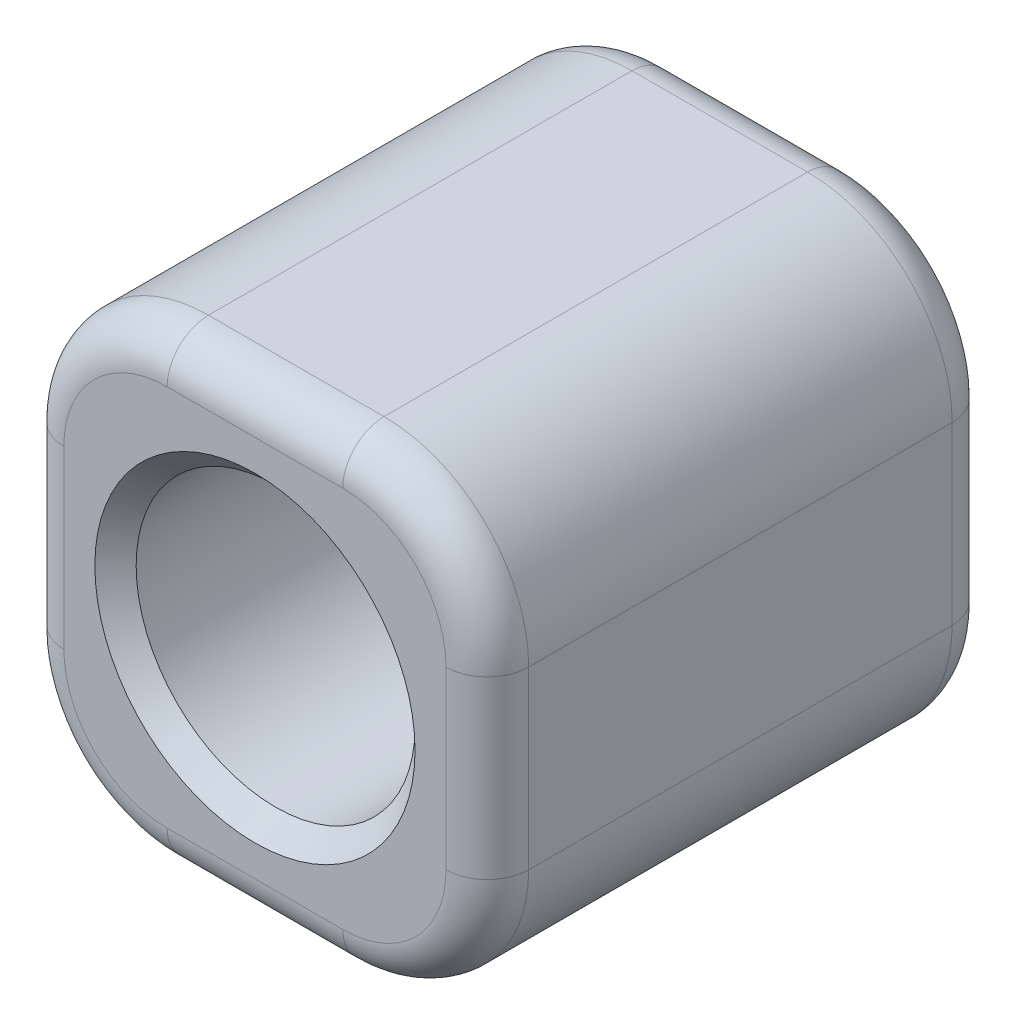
ISO-10303-21;
HEADER;
FILE_DESCRIPTION(('STEP AP214'),'2;1');
FILE_NAME('part.step','',(''),(''),'','','');
FILE_SCHEMA(('AUTOMOTIVE_DESIGN { 1 0 10303 214 1 1 1 1 }'));
ENDSEC;
DATA;
#1=APPLICATION_CONTEXT('core data for automotive mechanical design processes');
#2=APPLICATION_PROTOCOL_DEFINITION('international standard','automotive_design',2000,#1);
#3=PRODUCT_CONTEXT('',#1,'mechanical');
#4=PRODUCT('Part','Part','',(#3));
#5=PRODUCT_RELATED_PRODUCT_CATEGORY('part','',(#4));
#6=PRODUCT_DEFINITION_FORMATION('','',#4);
#7=PRODUCT_DEFINITION_CONTEXT('part definition',#1,'design');
#8=PRODUCT_DEFINITION('design','',#6,#7);
#9=PRODUCT_DEFINITION_SHAPE('','',#8);
#10=(LENGTH_UNIT() NAMED_UNIT(*) SI_UNIT(.MILLI.,.METRE.));
#11=(NAMED_UNIT(*) PLANE_ANGLE_UNIT() SI_UNIT($,.RADIAN.));
#12=(NAMED_UNIT(*) SI_UNIT($,.STERADIAN.) SOLID_ANGLE_UNIT());
#13=UNCERTAINTY_MEASURE_WITH_UNIT(LENGTH_MEASURE(1.E-05),#10,'distance_accuracy_value','');
#14=(GEOMETRIC_REPRESENTATION_CONTEXT(3) GLOBAL_UNCERTAINTY_ASSIGNED_CONTEXT((#13)) GLOBAL_UNIT_ASSIGNED_CONTEXT((#10,
#11,#12)) REPRESENTATION_CONTEXT('',''));
#15=CARTESIAN_POINT('',(0.,0.,0.));
#16=DIRECTION('',(0.,0.,1.));
#17=DIRECTION('',(1.,0.,0.));
#18=AXIS2_PLACEMENT_3D('',#15,#16,#17);
#19=CARTESIAN_POINT('',(-4.25,-4.25,24.5));
#20=DIRECTION('',(0.,0.,-1.));
#21=DIRECTION('',(-1.,0.,0.));
#22=AXIS2_PLACEMENT_3D('',#19,#20,#21);
#23=PLANE('',#22);
#24=CARTESIAN_POINT('',(0.,0.,24.5));
#25=DIRECTION('',(0.,0.,-1.));
#26=DIRECTION('',(-1.,0.,0.));
#27=AXIS2_PLACEMENT_3D('',#24,#25,#26);
#28=CIRCLE('',#27,7.75000000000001);
#29=CARTESIAN_POINT('',(-7.75000000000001,0.,24.5));
#30=VERTEX_POINT('',#29);
#31=EDGE_CURVE('E37',#30,#30,#28,.T.);
#32=ORIENTED_EDGE('',*,*,#31,.T.);
#33=EDGE_LOOP('',(#32));
#34=FACE_BOUND('',#33,.T.);
#35=CARTESIAN_POINT('',(-4.25,-4.25,24.5));
#36=DIRECTION('',(0.,0.,-1.));
#37=DIRECTION('',(-1.,0.,0.));
#38=AXIS2_PLACEMENT_3D('',#35,#36,#37);
#39=CIRCLE('',#38,5.);
#40=CARTESIAN_POINT('',(-9.25,-4.25,24.5));
#41=VERTEX_POINT('',#40);
#42=CARTESIAN_POINT('',(-4.25,-9.25000000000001,24.5));
#43=VERTEX_POINT('',#42);
#44=EDGE_CURVE('E201',#41,#43,#39,.F.);
#45=ORIENTED_EDGE('',*,*,#44,.T.);
#46=DIRECTION('',(1.,0.,0.));
#47=VECTOR('',#46,1.);
#48=CARTESIAN_POINT('',(-4.25,-9.25000000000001,24.5));
#49=LINE('',#48,#47);
#50=CARTESIAN_POINT('',(4.25,-9.25000000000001,24.5));
#51=VERTEX_POINT('',#50);
#52=EDGE_CURVE('E205',#43,#51,#49,.T.);
#53=ORIENTED_EDGE('',*,*,#52,.T.);
#54=CARTESIAN_POINT('',(4.25,-4.25,24.5));
#55=DIRECTION('',(0.,0.,-1.));
#56=DIRECTION('',(-1.,0.,0.));
#57=AXIS2_PLACEMENT_3D('',#54,#55,#56);
#58=CIRCLE('',#57,5.);
#59=CARTESIAN_POINT('',(9.25,-4.25,24.5));
#60=VERTEX_POINT('',#59);
#61=EDGE_CURVE('E203',#51,#60,#58,.F.);
#62=ORIENTED_EDGE('',*,*,#61,.T.);
#63=DIRECTION('',(0.,1.,0.));
#64=VECTOR('',#63,1.);
#65=CARTESIAN_POINT('',(9.25,-4.25,24.5));
#66=LINE('',#65,#64);
#67=CARTESIAN_POINT('',(9.25,4.25,24.5));
#68=VERTEX_POINT('',#67);
#69=EDGE_CURVE('E148',#60,#68,#66,.T.);
#70=ORIENTED_EDGE('',*,*,#69,.T.);
#71=CARTESIAN_POINT('',(4.25,4.25,24.5));
#72=DIRECTION('',(0.,0.,-1.));
#73=DIRECTION('',(-1.,0.,0.));
#74=AXIS2_PLACEMENT_3D('',#71,#72,#73);
#75=CIRCLE('',#74,5.);
#76=CARTESIAN_POINT('',(4.25,9.25,24.5));
#77=VERTEX_POINT('',#76);
#78=EDGE_CURVE('E143',#68,#77,#75,.F.);
#79=ORIENTED_EDGE('',*,*,#78,.T.);
#80=DIRECTION('',(-1.,0.,0.));
#81=VECTOR('',#80,1.);
#82=CARTESIAN_POINT('',(-4.25,9.25,24.5));
#83=LINE('',#82,#81);
#84=CARTESIAN_POINT('',(-4.25,9.25,24.5));
#85=VERTEX_POINT('',#84);
#86=EDGE_CURVE('E145',#77,#85,#83,.T.);
#87=ORIENTED_EDGE('',*,*,#86,.T.);
#88=CARTESIAN_POINT('',(-4.25,4.25,24.5));
#89=DIRECTION('',(0.,0.,-1.));
#90=DIRECTION('',(-1.,0.,0.));
#91=AXIS2_PLACEMENT_3D('',#88,#89,#90);
#92=CIRCLE('',#91,5.);
#93=CARTESIAN_POINT('',(-9.25,4.25,24.5));
#94=VERTEX_POINT('',#93);
#95=EDGE_CURVE('E154',#85,#94,#92,.F.);
#96=ORIENTED_EDGE('',*,*,#95,.T.);
#97=DIRECTION('',(0.,-1.,0.));
#98=VECTOR('',#97,1.);
#99=CARTESIAN_POINT('',(-9.25,-4.25,24.5));
#100=LINE('',#99,#98);
#101=EDGE_CURVE('E153',#94,#41,#100,.T.);
#102=ORIENTED_EDGE('',*,*,#101,.T.);
#103=EDGE_LOOP('',(#45,#53,#62,#70,#79,#87,#96,#102));
#104=FACE_BOUND('',#103,.T.);
#105=ADVANCED_FACE('F29',(#34,#104),#23,.F.);
#106=CARTESIAN_POINT('',(-4.25,-4.25,0.));
#107=DIRECTION('',(0.,0.,-1.));
#108=DIRECTION('',(-1.,0.,0.));
#109=AXIS2_PLACEMENT_3D('',#106,#107,#108);
#110=PLANE('',#109);
#111=CARTESIAN_POINT('',(0.,0.,0.));
#112=DIRECTION('',(0.,0.,-1.));
#113=DIRECTION('',(-1.,0.,0.));
#114=AXIS2_PLACEMENT_3D('',#111,#112,#113);
#115=CIRCLE('',#114,7.75000000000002);
#116=CARTESIAN_POINT('',(-7.75000000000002,0.,0.));
#117=VERTEX_POINT('',#116);
#118=EDGE_CURVE('E11',#117,#117,#115,.F.);
#119=ORIENTED_EDGE('',*,*,#118,.T.);
#120=EDGE_LOOP('',(#119));
#121=FACE_BOUND('',#120,.T.);
#122=CARTESIAN_POINT('',(4.25,-4.25,0.));
#123=DIRECTION('',(0.,0.,-1.));
#124=DIRECTION('',(-1.,0.,0.));
#125=AXIS2_PLACEMENT_3D('',#122,#123,#124);
#126=CIRCLE('',#125,5.);
#127=CARTESIAN_POINT('',(9.25,-4.25,0.));
#128=VERTEX_POINT('',#127);
#129=CARTESIAN_POINT('',(4.25,-9.25000000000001,0.));
#130=VERTEX_POINT('',#129);
#131=EDGE_CURVE('E226',#128,#130,#126,.T.);
#132=ORIENTED_EDGE('',*,*,#131,.T.);
#133=DIRECTION('',(1.,0.,0.));
#134=VECTOR('',#133,1.);
#135=CARTESIAN_POINT('',(-4.25,-9.25000000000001,0.));
#136=LINE('',#135,#134);
#137=CARTESIAN_POINT('',(-4.25,-9.25000000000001,0.));
#138=VERTEX_POINT('',#137);
#139=EDGE_CURVE('E228',#130,#138,#136,.F.);
#140=ORIENTED_EDGE('',*,*,#139,.T.);
#141=CARTESIAN_POINT('',(-4.25,-4.25,0.));
#142=DIRECTION('',(0.,0.,-1.));
#143=DIRECTION('',(-1.,0.,0.));
#144=AXIS2_PLACEMENT_3D('',#141,#142,#143);
#145=CIRCLE('',#144,5.);
#146=CARTESIAN_POINT('',(-9.25,-4.25,0.));
#147=VERTEX_POINT('',#146);
#148=EDGE_CURVE('E224',#138,#147,#145,.T.);
#149=ORIENTED_EDGE('',*,*,#148,.T.);
#150=DIRECTION('',(0.,-1.,0.));
#151=VECTOR('',#150,1.);
#152=CARTESIAN_POINT('',(-9.25,-4.25,0.));
#153=LINE('',#152,#151);
#154=CARTESIAN_POINT('',(-9.25,4.25,0.));
#155=VERTEX_POINT('',#154);
#156=EDGE_CURVE('E220',#147,#155,#153,.F.);
#157=ORIENTED_EDGE('',*,*,#156,.T.);
#158=CARTESIAN_POINT('',(-4.25,4.25,0.));
#159=DIRECTION('',(0.,0.,-1.));
#160=DIRECTION('',(-1.,0.,0.));
#161=AXIS2_PLACEMENT_3D('',#158,#159,#160);
#162=CIRCLE('',#161,5.);
#163=CARTESIAN_POINT('',(-4.25,9.25,0.));
#164=VERTEX_POINT('',#163);
#165=EDGE_CURVE('E216',#155,#164,#162,.T.);
#166=ORIENTED_EDGE('',*,*,#165,.T.);
#167=DIRECTION('',(-1.,0.,0.));
#168=VECTOR('',#167,1.);
#169=CARTESIAN_POINT('',(-4.25,9.25,0.));
#170=LINE('',#169,#168);
#171=CARTESIAN_POINT('',(4.25,9.25,0.));
#172=VERTEX_POINT('',#171);
#173=EDGE_CURVE('E214',#164,#172,#170,.F.);
#174=ORIENTED_EDGE('',*,*,#173,.T.);
#175=CARTESIAN_POINT('',(4.25,4.25,0.));
#176=DIRECTION('',(0.,0.,-1.));
#177=DIRECTION('',(-1.,0.,0.));
#178=AXIS2_PLACEMENT_3D('',#175,#176,#177);
#179=CIRCLE('',#178,5.);
#180=CARTESIAN_POINT('',(9.25,4.25,0.));
#181=VERTEX_POINT('',#180);
#182=EDGE_CURVE('E218',#172,#181,#179,.T.);
#183=ORIENTED_EDGE('',*,*,#182,.T.);
#184=DIRECTION('',(0.,1.,0.));
#185=VECTOR('',#184,1.);
#186=CARTESIAN_POINT('',(9.25,-4.25,0.));
#187=LINE('',#186,#185);
#188=EDGE_CURVE('E222',#181,#128,#187,.F.);
#189=ORIENTED_EDGE('',*,*,#188,.T.);
#190=EDGE_LOOP('',(#132,#140,#149,#157,#166,#174,#183,#189));
#191=FACE_BOUND('',#190,.T.);
#192=ADVANCED_FACE('F285',(#121,#191),#110,.T.);
#193=CARTESIAN_POINT('',(-4.25,-4.25,24.5));
#194=DIRECTION('',(0.,0.,-1.));
#195=DIRECTION('',(-1.,0.,0.));
#196=AXIS2_PLACEMENT_3D('',#193,#194,#195);
#197=CYLINDRICAL_SURFACE('',#196,7.);
#198=DIRECTION('',(0.,0.,-1.));
#199=VECTOR('',#198,1.);
#200=CARTESIAN_POINT('',(-4.25,-11.25,24.5));
#201=LINE('',#200,#199);
#202=CARTESIAN_POINT('',(-4.25,-11.25,22.5));
#203=VERTEX_POINT('',#202);
#204=CARTESIAN_POINT('',(-4.25,-11.25,2.));
#205=VERTEX_POINT('',#204);
#206=EDGE_CURVE('E165',#203,#205,#201,.T.);
#207=ORIENTED_EDGE('',*,*,#206,.F.);
#208=CARTESIAN_POINT('',(-4.25,-4.25,22.5));
#209=DIRECTION('',(0.,0.,-1.));
#210=DIRECTION('',(-1.,0.,0.));
#211=AXIS2_PLACEMENT_3D('',#208,#209,#210);
#212=CIRCLE('',#211,7.);
#213=CARTESIAN_POINT('',(-11.25,-4.25,22.5));
#214=VERTEX_POINT('',#213);
#215=EDGE_CURVE('E237',#203,#214,#212,.T.);
#216=ORIENTED_EDGE('',*,*,#215,.T.);
#217=DIRECTION('',(0.,0.,-1.));
#218=VECTOR('',#217,1.);
#219=CARTESIAN_POINT('',(-11.25,-4.25,24.5));
#220=LINE('',#219,#218);
#221=CARTESIAN_POINT('',(-11.25,-4.25,2.));
#222=VERTEX_POINT('',#221);
#223=EDGE_CURVE('E171',#214,#222,#220,.T.);
#224=ORIENTED_EDGE('',*,*,#223,.T.);
#225=CARTESIAN_POINT('',(-4.25,-4.25,2.));
#226=DIRECTION('',(0.,0.,-1.));
#227=DIRECTION('',(-1.,0.,0.));
#228=AXIS2_PLACEMENT_3D('',#225,#226,#227);
#229=CIRCLE('',#228,7.);
#230=EDGE_CURVE('E235',#222,#205,#229,.F.);
#231=ORIENTED_EDGE('',*,*,#230,.T.);
#232=EDGE_LOOP('',(#207,#216,#224,#231));
#233=FACE_BOUND('',#232,.T.);
#234=ADVANCED_FACE('F31',(#233),#197,.T.);
#235=CARTESIAN_POINT('',(-4.25,-11.25,24.5));
#236=DIRECTION('',(0.,1.,0.));
#237=DIRECTION('',(0.,0.,1.));
#238=AXIS2_PLACEMENT_3D('',#235,#236,#237);
#239=PLANE('',#238);
#240=DIRECTION('',(0.,0.,-1.));
#241=VECTOR('',#240,1.);
#242=CARTESIAN_POINT('',(4.25,-11.25,24.5));
#243=LINE('',#242,#241);
#244=CARTESIAN_POINT('',(4.25,-11.25,22.5));
#245=VERTEX_POINT('',#244);
#246=CARTESIAN_POINT('',(4.25,-11.25,2.));
#247=VERTEX_POINT('',#246);
#248=EDGE_CURVE('E193',#245,#247,#243,.T.);
#249=ORIENTED_EDGE('',*,*,#248,.F.);
#250=DIRECTION('',(1.,0.,0.));
#251=VECTOR('',#250,1.);
#252=CARTESIAN_POINT('',(-4.25,-11.25,22.5));
#253=LINE('',#252,#251);
#254=EDGE_CURVE('E211',#245,#203,#253,.F.);
#255=ORIENTED_EDGE('',*,*,#254,.T.);
#256=ORIENTED_EDGE('',*,*,#206,.T.);
#257=DIRECTION('',(1.,0.,0.));
#258=VECTOR('',#257,1.);
#259=CARTESIAN_POINT('',(-4.25,-11.25,2.));
#260=LINE('',#259,#258);
#261=EDGE_CURVE('E208',#205,#247,#260,.T.);
#262=ORIENTED_EDGE('',*,*,#261,.T.);
#263=EDGE_LOOP('',(#249,#255,#256,#262));
#264=FACE_BOUND('',#263,.T.);
#265=ADVANCED_FACE('F348',(#264),#239,.F.);
#266=CARTESIAN_POINT('',(4.25,-4.25,24.5));
#267=DIRECTION('',(0.,0.,-1.));
#268=DIRECTION('',(-1.,0.,0.));
#269=AXIS2_PLACEMENT_3D('',#266,#267,#268);
#270=CYLINDRICAL_SURFACE('',#269,7.);
#271=DIRECTION('',(0.,0.,-1.));
#272=VECTOR('',#271,1.);
#273=CARTESIAN_POINT('',(11.25,-4.25,24.5));
#274=LINE('',#273,#272);
#275=CARTESIAN_POINT('',(11.25,-4.25,22.5));
#276=VERTEX_POINT('',#275);
#277=CARTESIAN_POINT('',(11.25,-4.25,2.));
#278=VERTEX_POINT('',#277);
#279=EDGE_CURVE('E190',#276,#278,#274,.T.);
#280=ORIENTED_EDGE('',*,*,#279,.F.);
#281=CARTESIAN_POINT('',(4.25,-4.25,22.5));
#282=DIRECTION('',(0.,0.,-1.));
#283=DIRECTION('',(-1.,0.,0.));
#284=AXIS2_PLACEMENT_3D('',#281,#282,#283);
#285=CIRCLE('',#284,7.);
#286=EDGE_CURVE('E233',#276,#245,#285,.T.);
#287=ORIENTED_EDGE('',*,*,#286,.T.);
#288=ORIENTED_EDGE('',*,*,#248,.T.);
#289=CARTESIAN_POINT('',(4.25,-4.25,2.));
#290=DIRECTION('',(0.,0.,-1.));
#291=DIRECTION('',(-1.,0.,0.));
#292=AXIS2_PLACEMENT_3D('',#289,#290,#291);
#293=CIRCLE('',#292,7.);
#294=EDGE_CURVE('E231',#247,#278,#293,.F.);
#295=ORIENTED_EDGE('',*,*,#294,.T.);
#296=EDGE_LOOP('',(#280,#287,#288,#295));
#297=FACE_BOUND('',#296,.T.);
#298=ADVANCED_FACE('F344',(#297),#270,.T.);
#299=CARTESIAN_POINT('',(11.25,-4.25,24.5));
#300=DIRECTION('',(-1.,0.,0.));
#301=DIRECTION('',(0.,-1.,0.));
#302=AXIS2_PLACEMENT_3D('',#299,#300,#301);
#303=PLANE('',#302);
#304=DIRECTION('',(0.,0.,-1.));
#305=VECTOR('',#304,1.);
#306=CARTESIAN_POINT('',(11.25,4.25,24.5));
#307=LINE('',#306,#305);
#308=CARTESIAN_POINT('',(11.25,4.25,22.5));
#309=VERTEX_POINT('',#308);
#310=CARTESIAN_POINT('',(11.25,4.25,2.));
#311=VERTEX_POINT('',#310);
#312=EDGE_CURVE('E187',#309,#311,#307,.T.);
#313=ORIENTED_EDGE('',*,*,#312,.F.);
#314=DIRECTION('',(0.,1.,0.));
#315=VECTOR('',#314,1.);
#316=CARTESIAN_POINT('',(11.25,-4.25,22.5));
#317=LINE('',#316,#315);
#318=EDGE_CURVE('E241',#309,#276,#317,.F.);
#319=ORIENTED_EDGE('',*,*,#318,.T.);
#320=ORIENTED_EDGE('',*,*,#279,.T.);
#321=DIRECTION('',(0.,1.,0.));
#322=VECTOR('',#321,1.);
#323=CARTESIAN_POINT('',(11.25,-4.25,2.));
#324=LINE('',#323,#322);
#325=EDGE_CURVE('E239',#278,#311,#324,.T.);
#326=ORIENTED_EDGE('',*,*,#325,.T.);
#327=EDGE_LOOP('',(#313,#319,#320,#326));
#328=FACE_BOUND('',#327,.T.);
#329=ADVANCED_FACE('F341',(#328),#303,.F.);
#330=CARTESIAN_POINT('',(4.25,4.25,24.5));
#331=DIRECTION('',(0.,0.,-1.));
#332=DIRECTION('',(-1.,0.,0.));
#333=AXIS2_PLACEMENT_3D('',#330,#331,#332);
#334=CYLINDRICAL_SURFACE('',#333,7.);
#335=DIRECTION('',(0.,0.,-1.));
#336=VECTOR('',#335,1.);
#337=CARTESIAN_POINT('',(4.25,11.25,24.5));
#338=LINE('',#337,#336);
#339=CARTESIAN_POINT('',(4.25,11.25,22.5));
#340=VERTEX_POINT('',#339);
#341=CARTESIAN_POINT('',(4.25,11.25,2.));
#342=VERTEX_POINT('',#341);
#343=EDGE_CURVE('E185',#340,#342,#338,.T.);
#344=ORIENTED_EDGE('',*,*,#343,.F.);
#345=CARTESIAN_POINT('',(4.25,4.25,22.5));
#346=DIRECTION('',(0.,0.,-1.));
#347=DIRECTION('',(-1.,0.,0.));
#348=AXIS2_PLACEMENT_3D('',#345,#346,#347);
#349=CIRCLE('',#348,7.);
#350=EDGE_CURVE('E168',#340,#309,#349,.T.);
#351=ORIENTED_EDGE('',*,*,#350,.T.);
#352=ORIENTED_EDGE('',*,*,#312,.T.);
#353=CARTESIAN_POINT('',(4.25,4.25,2.));
#354=DIRECTION('',(0.,0.,-1.));
#355=DIRECTION('',(-1.,0.,0.));
#356=AXIS2_PLACEMENT_3D('',#353,#354,#355);
#357=CIRCLE('',#356,7.);
#358=EDGE_CURVE('E247',#311,#342,#357,.F.);
#359=ORIENTED_EDGE('',*,*,#358,.T.);
#360=EDGE_LOOP('',(#344,#351,#352,#359));
#361=FACE_BOUND('',#360,.T.);
#362=ADVANCED_FACE('F396',(#361),#334,.T.);
#363=CARTESIAN_POINT('',(-4.25,11.25,24.5));
#364=DIRECTION('',(0.,-1.,0.));
#365=DIRECTION('',(1.,0.,0.));
#366=AXIS2_PLACEMENT_3D('',#363,#364,#365);
#367=PLANE('',#366);
#368=DIRECTION('',(0.,0.,-1.));
#369=VECTOR('',#368,1.);
#370=CARTESIAN_POINT('',(-4.25,11.25,24.5));
#371=LINE('',#370,#369);
#372=CARTESIAN_POINT('',(-4.25,11.25,22.5));
#373=VERTEX_POINT('',#372);
#374=CARTESIAN_POINT('',(-4.25,11.25,2.));
#375=VERTEX_POINT('',#374);
#376=EDGE_CURVE('E183',#373,#375,#371,.T.);
#377=ORIENTED_EDGE('',*,*,#376,.F.);
#378=DIRECTION('',(-1.,0.,0.));
#379=VECTOR('',#378,1.);
#380=CARTESIAN_POINT('',(-4.25,11.25,22.5));
#381=LINE('',#380,#379);
#382=EDGE_CURVE('E254',#373,#340,#381,.F.);
#383=ORIENTED_EDGE('',*,*,#382,.T.);
#384=ORIENTED_EDGE('',*,*,#343,.T.);
#385=DIRECTION('',(-1.,0.,0.));
#386=VECTOR('',#385,1.);
#387=CARTESIAN_POINT('',(-4.25,11.25,2.));
#388=LINE('',#387,#386);
#389=EDGE_CURVE('E44',#342,#375,#388,.T.);
#390=ORIENTED_EDGE('',*,*,#389,.T.);
#391=EDGE_LOOP('',(#377,#383,#384,#390));
#392=FACE_BOUND('',#391,.T.);
#393=ADVANCED_FACE('F393',(#392),#367,.F.);
#394=CARTESIAN_POINT('',(-4.25,4.25,24.5));
#395=DIRECTION('',(0.,0.,-1.));
#396=DIRECTION('',(-1.,0.,0.));
#397=AXIS2_PLACEMENT_3D('',#394,#395,#396);
#398=CYLINDRICAL_SURFACE('',#397,7.);
#399=DIRECTION('',(0.,0.,-1.));
#400=VECTOR('',#399,1.);
#401=CARTESIAN_POINT('',(-11.25,4.25,24.5));
#402=LINE('',#401,#400);
#403=CARTESIAN_POINT('',(-11.25,4.25,22.5));
#404=VERTEX_POINT('',#403);
#405=CARTESIAN_POINT('',(-11.25,4.25,2.));
#406=VERTEX_POINT('',#405);
#407=EDGE_CURVE('E180',#404,#406,#402,.T.);
#408=ORIENTED_EDGE('',*,*,#407,.F.);
#409=CARTESIAN_POINT('',(-4.25,4.25,22.5));
#410=DIRECTION('',(0.,0.,-1.));
#411=DIRECTION('',(-1.,0.,0.));
#412=AXIS2_PLACEMENT_3D('',#409,#410,#411);
#413=CIRCLE('',#412,7.);
#414=EDGE_CURVE('E51',#404,#373,#413,.T.);
#415=ORIENTED_EDGE('',*,*,#414,.T.);
#416=ORIENTED_EDGE('',*,*,#376,.T.);
#417=CARTESIAN_POINT('',(-4.25,4.25,2.));
#418=DIRECTION('',(0.,0.,-1.));
#419=DIRECTION('',(-1.,0.,0.));
#420=AXIS2_PLACEMENT_3D('',#417,#418,#419);
#421=CIRCLE('',#420,7.);
#422=EDGE_CURVE('E250',#375,#406,#421,.F.);
#423=ORIENTED_EDGE('',*,*,#422,.T.);
#424=EDGE_LOOP('',(#408,#415,#416,#423));
#425=FACE_BOUND('',#424,.T.);
#426=ADVANCED_FACE('F390',(#425),#398,.T.);
#427=CARTESIAN_POINT('',(-11.25,-4.25,24.5));
#428=DIRECTION('',(1.,0.,0.));
#429=DIRECTION('',(0.,1.,0.));
#430=AXIS2_PLACEMENT_3D('',#427,#428,#429);
#431=PLANE('',#430);
#432=ORIENTED_EDGE('',*,*,#223,.F.);
#433=DIRECTION('',(0.,-1.,0.));
#434=VECTOR('',#433,1.);
#435=CARTESIAN_POINT('',(-11.25,-4.25,22.5));
#436=LINE('',#435,#434);
#437=EDGE_CURVE('E245',#214,#404,#436,.F.);
#438=ORIENTED_EDGE('',*,*,#437,.T.);
#439=ORIENTED_EDGE('',*,*,#407,.T.);
#440=DIRECTION('',(0.,-1.,0.));
#441=VECTOR('',#440,1.);
#442=CARTESIAN_POINT('',(-11.25,-4.25,2.));
#443=LINE('',#442,#441);
#444=EDGE_CURVE('E243',#406,#222,#443,.T.);
#445=ORIENTED_EDGE('',*,*,#444,.T.);
#446=EDGE_LOOP('',(#432,#438,#439,#445));
#447=FACE_BOUND('',#446,.T.);
#448=ADVANCED_FACE('F276',(#447),#431,.F.);
#449=CARTESIAN_POINT('',(0.,0.,24.5));
#450=DIRECTION('',(0.,0.,-1.));
#451=DIRECTION('',(-1.,0.,0.));
#452=AXIS2_PLACEMENT_3D('',#449,#450,#451);
#453=CYLINDRICAL_SURFACE('',#452,6.75);
#454=CARTESIAN_POINT('',(0.,0.,23.5));
#455=DIRECTION('',(0.,0.,-1.));
#456=DIRECTION('',(-1.,0.,0.));
#457=AXIS2_PLACEMENT_3D('',#454,#455,#456);
#458=CIRCLE('',#457,6.75);
#459=CARTESIAN_POINT('',(-6.75,0.,23.5));
#460=VERTEX_POINT('',#459);
#461=EDGE_CURVE('E259',#460,#460,#458,.F.);
#462=ORIENTED_EDGE('',*,*,#461,.T.);
#463=EDGE_LOOP('',(#462));
#464=FACE_BOUND('',#463,.T.);
#465=CARTESIAN_POINT('',(0.,0.,1.00000000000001));
#466=DIRECTION('',(0.,0.,-1.));
#467=DIRECTION('',(-1.,0.,0.));
#468=AXIS2_PLACEMENT_3D('',#465,#466,#467);
#469=CIRCLE('',#468,6.75);
#470=CARTESIAN_POINT('',(-6.75,0.,1.00000000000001));
#471=VERTEX_POINT('',#470);
#472=EDGE_CURVE('E256',#471,#471,#469,.T.);
#473=ORIENTED_EDGE('',*,*,#472,.T.);
#474=EDGE_LOOP('',(#473));
#475=FACE_BOUND('',#474,.T.);
#476=ADVANCED_FACE('F273',(#464,#475),#453,.F.);
#477=CARTESIAN_POINT('',(-4.25,9.25,22.5));
#478=DIRECTION('',(-1.,0.,0.));
#479=DIRECTION('',(0.,-1.,0.));
#480=AXIS2_PLACEMENT_3D('',#477,#478,#479);
#481=CYLINDRICAL_SURFACE('',#480,2.);
#482=CARTESIAN_POINT('',(4.25,9.25,22.5));
#483=DIRECTION('',(1.,0.,0.));
#484=DIRECTION('',(0.,0.,-1.));
#485=AXIS2_PLACEMENT_3D('',#482,#483,#484);
#486=CIRCLE('',#485,2.);
#487=EDGE_CURVE('E160',#340,#77,#486,.T.);
#488=ORIENTED_EDGE('',*,*,#487,.F.);
#489=ORIENTED_EDGE('',*,*,#382,.F.);
#490=CARTESIAN_POINT('',(-4.25,9.25,22.5));
#491=DIRECTION('',(-1.,0.,0.));
#492=DIRECTION('',(0.,-1.,0.));
#493=AXIS2_PLACEMENT_3D('',#490,#491,#492);
#494=CIRCLE('',#493,2.);
#495=EDGE_CURVE('E163',#85,#373,#494,.T.);
#496=ORIENTED_EDGE('',*,*,#495,.F.);
#497=ORIENTED_EDGE('',*,*,#86,.F.);
#498=EDGE_LOOP('',(#488,#489,#496,#497));
#499=FACE_BOUND('',#498,.T.);
#500=ADVANCED_FACE('F158',(#499),#481,.T.);
#501=CARTESIAN_POINT('',(-4.25,4.25,22.5));
#502=DIRECTION('',(0.,0.,-1.));
#503=DIRECTION('',(-1.,0.,0.));
#504=AXIS2_PLACEMENT_3D('',#501,#502,#503);
#505=TOROIDAL_SURFACE('',#504,5.,2.);
#506=ORIENTED_EDGE('',*,*,#495,.T.);
#507=ORIENTED_EDGE('',*,*,#414,.F.);
#508=CARTESIAN_POINT('',(-9.25,4.25,22.5));
#509=DIRECTION('',(0.,-1.,0.));
#510=DIRECTION('',(0.,0.,-1.));
#511=AXIS2_PLACEMENT_3D('',#508,#509,#510);
#512=CIRCLE('',#511,2.);
#513=EDGE_CURVE('E169',#94,#404,#512,.T.);
#514=ORIENTED_EDGE('',*,*,#513,.F.);
#515=ORIENTED_EDGE('',*,*,#95,.F.);
#516=EDGE_LOOP('',(#506,#507,#514,#515));
#517=FACE_BOUND('',#516,.T.);
#518=ADVANCED_FACE('F374',(#517),#505,.T.);
#519=CARTESIAN_POINT('',(4.25,4.25,22.5));
#520=DIRECTION('',(0.,0.,-1.));
#521=DIRECTION('',(-1.,0.,0.));
#522=AXIS2_PLACEMENT_3D('',#519,#520,#521);
#523=TOROIDAL_SURFACE('',#522,5.,2.);
#524=ORIENTED_EDGE('',*,*,#487,.T.);
#525=ORIENTED_EDGE('',*,*,#78,.F.);
#526=CARTESIAN_POINT('',(9.25,4.25,22.5));
#527=DIRECTION('',(0.,-1.,0.));
#528=DIRECTION('',(1.,0.,0.));
#529=AXIS2_PLACEMENT_3D('',#526,#527,#528);
#530=CIRCLE('',#529,2.);
#531=EDGE_CURVE('E174',#309,#68,#530,.T.);
#532=ORIENTED_EDGE('',*,*,#531,.F.);
#533=ORIENTED_EDGE('',*,*,#350,.F.);
#534=EDGE_LOOP('',(#524,#525,#532,#533));
#535=FACE_BOUND('',#534,.T.);
#536=ADVANCED_FACE('F167',(#535),#523,.T.);
#537=CARTESIAN_POINT('',(-9.25,-4.25,22.5));
#538=DIRECTION('',(0.,-1.,0.));
#539=DIRECTION('',(1.,0.,0.));
#540=AXIS2_PLACEMENT_3D('',#537,#538,#539);
#541=CYLINDRICAL_SURFACE('',#540,2.);
#542=ORIENTED_EDGE('',*,*,#513,.T.);
#543=ORIENTED_EDGE('',*,*,#437,.F.);
#544=CARTESIAN_POINT('',(-9.25,-4.25,22.5));
#545=DIRECTION('',(0.,-1.,0.));
#546=DIRECTION('',(1.,0.,0.));
#547=AXIS2_PLACEMENT_3D('',#544,#545,#546);
#548=CIRCLE('',#547,2.);
#549=EDGE_CURVE('E331',#41,#214,#548,.T.);
#550=ORIENTED_EDGE('',*,*,#549,.F.);
#551=ORIENTED_EDGE('',*,*,#101,.F.);
#552=EDGE_LOOP('',(#542,#543,#550,#551));
#553=FACE_BOUND('',#552,.T.);
#554=ADVANCED_FACE('F371',(#553),#541,.T.);
#555=CARTESIAN_POINT('',(9.25,-4.25,22.5));
#556=DIRECTION('',(0.,1.,0.));
#557=DIRECTION('',(-1.,0.,0.));
#558=AXIS2_PLACEMENT_3D('',#555,#556,#557);
#559=CYLINDRICAL_SURFACE('',#558,2.);
#560=ORIENTED_EDGE('',*,*,#531,.T.);
#561=ORIENTED_EDGE('',*,*,#69,.F.);
#562=CARTESIAN_POINT('',(9.25,-4.25,22.5));
#563=DIRECTION('',(0.,-1.,0.));
#564=DIRECTION('',(0.,0.,-1.));
#565=AXIS2_PLACEMENT_3D('',#562,#563,#564);
#566=CIRCLE('',#565,2.);
#567=EDGE_CURVE('E328',#276,#60,#566,.T.);
#568=ORIENTED_EDGE('',*,*,#567,.F.);
#569=ORIENTED_EDGE('',*,*,#318,.F.);
#570=EDGE_LOOP('',(#560,#561,#568,#569));
#571=FACE_BOUND('',#570,.T.);
#572=ADVANCED_FACE('F335',(#571),#559,.T.);
#573=CARTESIAN_POINT('',(-4.25,-4.25,22.5));
#574=DIRECTION('',(0.,0.,-1.));
#575=DIRECTION('',(-1.,0.,0.));
#576=AXIS2_PLACEMENT_3D('',#573,#574,#575);
#577=TOROIDAL_SURFACE('',#576,5.,2.);
#578=ORIENTED_EDGE('',*,*,#549,.T.);
#579=ORIENTED_EDGE('',*,*,#215,.F.);
#580=CARTESIAN_POINT('',(-4.25,-9.25000000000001,22.5));
#581=DIRECTION('',(1.,0.,0.));
#582=DIRECTION('',(0.,0.,-1.));
#583=AXIS2_PLACEMENT_3D('',#580,#581,#582);
#584=CIRCLE('',#583,2.);
#585=EDGE_CURVE('E326',#43,#203,#584,.T.);
#586=ORIENTED_EDGE('',*,*,#585,.F.);
#587=ORIENTED_EDGE('',*,*,#44,.F.);
#588=EDGE_LOOP('',(#578,#579,#586,#587));
#589=FACE_BOUND('',#588,.T.);
#590=ADVANCED_FACE('F363',(#589),#577,.T.);
#591=CARTESIAN_POINT('',(4.25,-4.25,22.5));
#592=DIRECTION('',(0.,0.,-1.));
#593=DIRECTION('',(-1.,0.,0.));
#594=AXIS2_PLACEMENT_3D('',#591,#592,#593);
#595=TOROIDAL_SURFACE('',#594,5.,2.);
#596=ORIENTED_EDGE('',*,*,#567,.T.);
#597=ORIENTED_EDGE('',*,*,#61,.F.);
#598=CARTESIAN_POINT('',(4.25,-9.25,22.5));
#599=DIRECTION('',(-1.,0.,0.));
#600=DIRECTION('',(0.,0.,1.));
#601=AXIS2_PLACEMENT_3D('',#598,#599,#600);
#602=CIRCLE('',#601,2.);
#603=EDGE_CURVE('E324',#245,#51,#602,.T.);
#604=ORIENTED_EDGE('',*,*,#603,.F.);
#605=ORIENTED_EDGE('',*,*,#286,.F.);
#606=EDGE_LOOP('',(#596,#597,#604,#605));
#607=FACE_BOUND('',#606,.T.);
#608=ADVANCED_FACE('F358',(#607),#595,.T.);
#609=CARTESIAN_POINT('',(-4.25,-9.25000000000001,22.5));
#610=DIRECTION('',(1.,0.,0.));
#611=DIRECTION('',(0.,0.,-1.));
#612=AXIS2_PLACEMENT_3D('',#609,#610,#611);
#613=CYLINDRICAL_SURFACE('',#612,2.);
#614=ORIENTED_EDGE('',*,*,#585,.T.);
#615=ORIENTED_EDGE('',*,*,#254,.F.);
#616=ORIENTED_EDGE('',*,*,#603,.T.);
#617=ORIENTED_EDGE('',*,*,#52,.F.);
#618=EDGE_LOOP('',(#614,#615,#616,#617));
#619=FACE_BOUND('',#618,.T.);
#620=ADVANCED_FACE('F352',(#619),#613,.T.);
#621=CARTESIAN_POINT('',(-4.25,9.25,2.));
#622=DIRECTION('',(1.,0.,0.));
#623=DIRECTION('',(0.,1.,0.));
#624=AXIS2_PLACEMENT_3D('',#621,#622,#623);
#625=CYLINDRICAL_SURFACE('',#624,2.);
#626=CARTESIAN_POINT('',(4.25,9.25,2.));
#627=DIRECTION('',(1.,0.,0.));
#628=DIRECTION('',(0.,0.,-1.));
#629=AXIS2_PLACEMENT_3D('',#626,#627,#628);
#630=CIRCLE('',#629,2.);
#631=EDGE_CURVE('E318',#172,#342,#630,.T.);
#632=ORIENTED_EDGE('',*,*,#631,.F.);
#633=ORIENTED_EDGE('',*,*,#173,.F.);
#634=CARTESIAN_POINT('',(-4.25,9.25,2.));
#635=DIRECTION('',(-1.,0.,0.));
#636=DIRECTION('',(0.,-1.,0.));
#637=AXIS2_PLACEMENT_3D('',#634,#635,#636);
#638=CIRCLE('',#637,2.);
#639=EDGE_CURVE('E321',#375,#164,#638,.T.);
#640=ORIENTED_EDGE('',*,*,#639,.F.);
#641=ORIENTED_EDGE('',*,*,#389,.F.);
#642=EDGE_LOOP('',(#632,#633,#640,#641));
#643=FACE_BOUND('',#642,.T.);
#644=ADVANCED_FACE('F510',(#643),#625,.T.);
#645=CARTESIAN_POINT('',(-4.25,4.25,2.));
#646=DIRECTION('',(0.,0.,-1.));
#647=DIRECTION('',(-1.,0.,0.));
#648=AXIS2_PLACEMENT_3D('',#645,#646,#647);
#649=TOROIDAL_SURFACE('',#648,5.,2.);
#650=ORIENTED_EDGE('',*,*,#639,.T.);
#651=ORIENTED_EDGE('',*,*,#165,.F.);
#652=CARTESIAN_POINT('',(-9.25,4.25,2.));
#653=DIRECTION('',(0.,-1.,0.));
#654=DIRECTION('',(0.,0.,-1.));
#655=AXIS2_PLACEMENT_3D('',#652,#653,#654);
#656=CIRCLE('',#655,2.);
#657=EDGE_CURVE('E315',#406,#155,#656,.T.);
#658=ORIENTED_EDGE('',*,*,#657,.F.);
#659=ORIENTED_EDGE('',*,*,#422,.F.);
#660=EDGE_LOOP('',(#650,#651,#658,#659));
#661=FACE_BOUND('',#660,.T.);
#662=ADVANCED_FACE('F518',(#661),#649,.T.);
#663=CARTESIAN_POINT('',(4.25,4.25,2.));
#664=DIRECTION('',(0.,0.,-1.));
#665=DIRECTION('',(-1.,0.,0.));
#666=AXIS2_PLACEMENT_3D('',#663,#664,#665);
#667=TOROIDAL_SURFACE('',#666,5.,2.);
#668=ORIENTED_EDGE('',*,*,#631,.T.);
#669=ORIENTED_EDGE('',*,*,#358,.F.);
#670=CARTESIAN_POINT('',(9.25,4.25,2.));
#671=DIRECTION('',(0.,-1.,0.));
#672=DIRECTION('',(0.,0.,-1.));
#673=AXIS2_PLACEMENT_3D('',#670,#671,#672);
#674=CIRCLE('',#673,2.);
#675=EDGE_CURVE('E312',#181,#311,#674,.T.);
#676=ORIENTED_EDGE('',*,*,#675,.F.);
#677=ORIENTED_EDGE('',*,*,#182,.F.);
#678=EDGE_LOOP('',(#668,#669,#676,#677));
#679=FACE_BOUND('',#678,.T.);
#680=ADVANCED_FACE('F527',(#679),#667,.T.);
#681=CARTESIAN_POINT('',(-9.25,-4.25,2.));
#682=DIRECTION('',(0.,1.,0.));
#683=DIRECTION('',(-1.,0.,0.));
#684=AXIS2_PLACEMENT_3D('',#681,#682,#683);
#685=CYLINDRICAL_SURFACE('',#684,2.);
#686=ORIENTED_EDGE('',*,*,#657,.T.);
#687=ORIENTED_EDGE('',*,*,#156,.F.);
#688=CARTESIAN_POINT('',(-9.25,-4.25,2.));
#689=DIRECTION('',(0.,-1.,0.));
#690=DIRECTION('',(0.,0.,-1.));
#691=AXIS2_PLACEMENT_3D('',#688,#689,#690);
#692=CIRCLE('',#691,2.);
#693=EDGE_CURVE('E309',#222,#147,#692,.T.);
#694=ORIENTED_EDGE('',*,*,#693,.F.);
#695=ORIENTED_EDGE('',*,*,#444,.F.);
#696=EDGE_LOOP('',(#686,#687,#694,#695));
#697=FACE_BOUND('',#696,.T.);
#698=ADVANCED_FACE('F536',(#697),#685,.T.);
#699=CARTESIAN_POINT('',(9.25,-4.25,2.));
#700=DIRECTION('',(0.,-1.,0.));
#701=DIRECTION('',(1.,0.,0.));
#702=AXIS2_PLACEMENT_3D('',#699,#700,#701);
#703=CYLINDRICAL_SURFACE('',#702,2.);
#704=ORIENTED_EDGE('',*,*,#675,.T.);
#705=ORIENTED_EDGE('',*,*,#325,.F.);
#706=CARTESIAN_POINT('',(9.25,-4.25,2.));
#707=DIRECTION('',(0.,-1.,0.));
#708=DIRECTION('',(0.,0.,-1.));
#709=AXIS2_PLACEMENT_3D('',#706,#707,#708);
#710=CIRCLE('',#709,2.);
#711=EDGE_CURVE('E305',#128,#278,#710,.T.);
#712=ORIENTED_EDGE('',*,*,#711,.F.);
#713=ORIENTED_EDGE('',*,*,#188,.F.);
#714=EDGE_LOOP('',(#704,#705,#712,#713));
#715=FACE_BOUND('',#714,.T.);
#716=ADVANCED_FACE('F545',(#715),#703,.T.);
#717=CARTESIAN_POINT('',(-4.25,-4.25,2.));
#718=DIRECTION('',(0.,0.,-1.));
#719=DIRECTION('',(-1.,0.,0.));
#720=AXIS2_PLACEMENT_3D('',#717,#718,#719);
#721=TOROIDAL_SURFACE('',#720,5.,2.);
#722=ORIENTED_EDGE('',*,*,#693,.T.);
#723=ORIENTED_EDGE('',*,*,#148,.F.);
#724=CARTESIAN_POINT('',(-4.25,-9.25,2.));
#725=DIRECTION('',(1.,0.,0.));
#726=DIRECTION('',(0.,0.,-1.));
#727=AXIS2_PLACEMENT_3D('',#724,#725,#726);
#728=CIRCLE('',#727,2.);
#729=EDGE_CURVE('E301',#205,#138,#728,.T.);
#730=ORIENTED_EDGE('',*,*,#729,.F.);
#731=ORIENTED_EDGE('',*,*,#230,.F.);
#732=EDGE_LOOP('',(#722,#723,#730,#731));
#733=FACE_BOUND('',#732,.T.);
#734=ADVANCED_FACE('F554',(#733),#721,.T.);
#735=CARTESIAN_POINT('',(4.25,-4.25,2.));
#736=DIRECTION('',(0.,0.,-1.));
#737=DIRECTION('',(-1.,0.,0.));
#738=AXIS2_PLACEMENT_3D('',#735,#736,#737);
#739=TOROIDAL_SURFACE('',#738,5.,2.);
#740=ORIENTED_EDGE('',*,*,#711,.T.);
#741=ORIENTED_EDGE('',*,*,#294,.F.);
#742=CARTESIAN_POINT('',(4.25,-9.25000000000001,2.));
#743=DIRECTION('',(-1.,0.,0.));
#744=DIRECTION('',(0.,0.,1.));
#745=AXIS2_PLACEMENT_3D('',#742,#743,#744);
#746=CIRCLE('',#745,2.);
#747=EDGE_CURVE('E298',#130,#247,#746,.T.);
#748=ORIENTED_EDGE('',*,*,#747,.F.);
#749=ORIENTED_EDGE('',*,*,#131,.F.);
#750=EDGE_LOOP('',(#740,#741,#748,#749));
#751=FACE_BOUND('',#750,.T.);
#752=ADVANCED_FACE('F303',(#751),#739,.T.);
#753=CARTESIAN_POINT('',(-4.25,-9.25000000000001,2.));
#754=DIRECTION('',(-1.,0.,0.));
#755=DIRECTION('',(0.,0.,1.));
#756=AXIS2_PLACEMENT_3D('',#753,#754,#755);
#757=CYLINDRICAL_SURFACE('',#756,2.);
#758=ORIENTED_EDGE('',*,*,#729,.T.);
#759=ORIENTED_EDGE('',*,*,#139,.F.);
#760=ORIENTED_EDGE('',*,*,#747,.T.);
#761=ORIENTED_EDGE('',*,*,#261,.F.);
#762=EDGE_LOOP('',(#758,#759,#760,#761));
#763=FACE_BOUND('',#762,.T.);
#764=ADVANCED_FACE('F269',(#763),#757,.T.);
#765=CARTESIAN_POINT('',(0.,0.,23.5));
#766=DIRECTION('',(0.,0.,1.));
#767=DIRECTION('',(1.,0.,0.));
#768=AXIS2_PLACEMENT_3D('',#765,#766,#767);
#769=CONICAL_SURFACE('',#768,6.75,0.785398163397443);
#770=ORIENTED_EDGE('',*,*,#31,.F.);
#771=EDGE_LOOP('',(#770));
#772=FACE_BOUND('',#771,.T.);
#773=ORIENTED_EDGE('',*,*,#461,.F.);
#774=EDGE_LOOP('',(#773));
#775=FACE_BOUND('',#774,.T.);
#776=ADVANCED_FACE('F265',(#772,#775),#769,.F.);
#777=CARTESIAN_POINT('',(0.,0.,0.));
#778=DIRECTION('',(0.,0.,-1.));
#779=DIRECTION('',(-1.,0.,0.));
#780=AXIS2_PLACEMENT_3D('',#777,#778,#779);
#781=CONICAL_SURFACE('',#780,7.75000000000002,0.785398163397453);
#782=ORIENTED_EDGE('',*,*,#472,.F.);
#783=EDGE_LOOP('',(#782));
#784=FACE_BOUND('',#783,.T.);
#785=ORIENTED_EDGE('',*,*,#118,.F.);
#786=EDGE_LOOP('',(#785));
#787=FACE_BOUND('',#786,.T.);
#788=ADVANCED_FACE('F268',(#784,#787),#781,.F.);
#789=CLOSED_SHELL('',(#105,#192,#234,#265,#298,#329,#362,#393,#426,#448,#476,#500,#518,#536,
#554,#572,#590,#608,#620,#644,#662,#680,#698,#716,#734,#752,#764,#776,#788));
#790=MANIFOLD_SOLID_BREP('B2',#789);
#791=ADVANCED_BREP_SHAPE_REPRESENTATION('',(#18,#790),#14);
#792=SHAPE_DEFINITION_REPRESENTATION(#9,#791);
ENDSEC;
END-ISO-10303-21;
